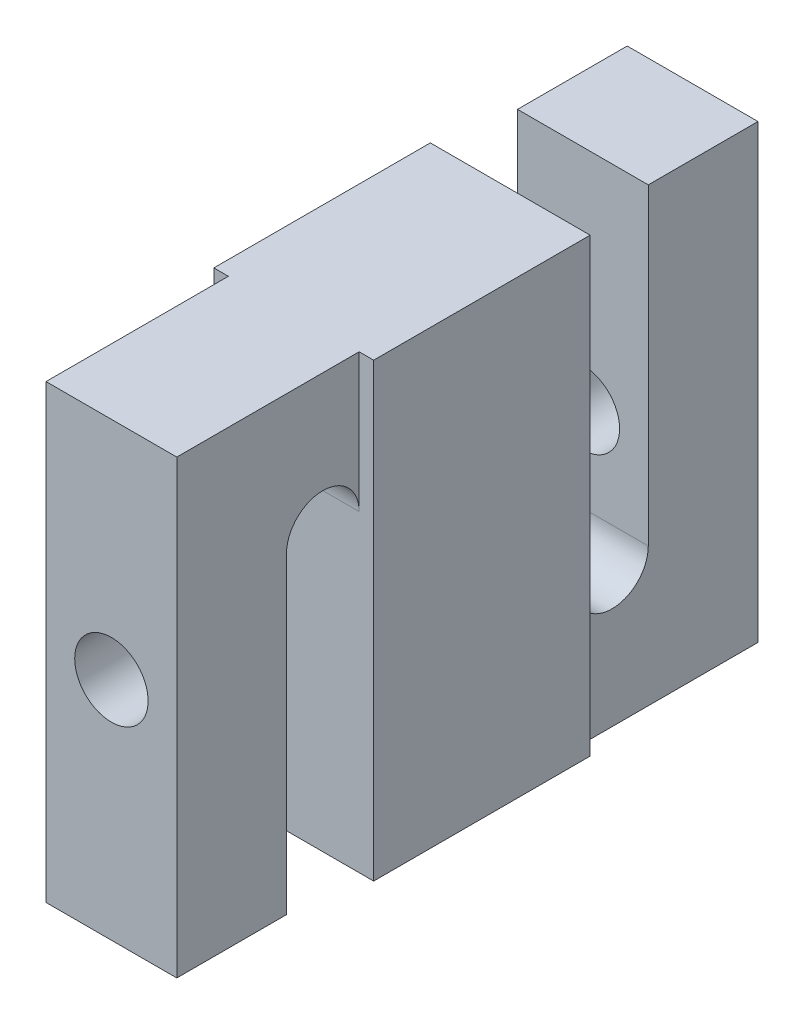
ISO-10303-21;
HEADER;
FILE_DESCRIPTION(('STEP AP214'),'2;1');
FILE_NAME('part.step','',(''),(''),'','','');
FILE_SCHEMA(('AUTOMOTIVE_DESIGN { 1 0 10303 214 1 1 1 1 }'));
ENDSEC;
DATA;
#1=APPLICATION_CONTEXT('core data for automotive mechanical design processes');
#2=APPLICATION_PROTOCOL_DEFINITION('international standard','automotive_design',2000,#1);
#3=PRODUCT_CONTEXT('',#1,'mechanical');
#4=PRODUCT('Part','Part','',(#3));
#5=PRODUCT_RELATED_PRODUCT_CATEGORY('part','',(#4));
#6=PRODUCT_DEFINITION_FORMATION('','',#4);
#7=PRODUCT_DEFINITION_CONTEXT('part definition',#1,'design');
#8=PRODUCT_DEFINITION('design','',#6,#7);
#9=PRODUCT_DEFINITION_SHAPE('','',#8);
#10=(LENGTH_UNIT() NAMED_UNIT(*) SI_UNIT(.MILLI.,.METRE.));
#11=(NAMED_UNIT(*) PLANE_ANGLE_UNIT() SI_UNIT($,.RADIAN.));
#12=(NAMED_UNIT(*) SI_UNIT($,.STERADIAN.) SOLID_ANGLE_UNIT());
#13=UNCERTAINTY_MEASURE_WITH_UNIT(LENGTH_MEASURE(1.E-05),#10,'distance_accuracy_value','');
#14=(GEOMETRIC_REPRESENTATION_CONTEXT(3) GLOBAL_UNCERTAINTY_ASSIGNED_CONTEXT((#13)) GLOBAL_UNIT_ASSIGNED_CONTEXT((#10,
#11,#12)) REPRESENTATION_CONTEXT('',''));
#15=CARTESIAN_POINT('',(0.,0.,0.));
#16=DIRECTION('',(0.,0.,1.));
#17=DIRECTION('',(1.,0.,0.));
#18=AXIS2_PLACEMENT_3D('',#15,#16,#17);
#19=CARTESIAN_POINT('',(9.,0.,39.9));
#20=DIRECTION('',(0.,0.,-1.));
#21=DIRECTION('',(-1.,0.,0.));
#22=AXIS2_PLACEMENT_3D('',#19,#20,#21);
#23=CYLINDRICAL_SURFACE('',#22,5.053);
#24=CARTESIAN_POINT('',(9.,0.,24.9));
#25=DIRECTION('',(0.,0.,-1.));
#26=DIRECTION('',(-1.,0.,0.));
#27=AXIS2_PLACEMENT_3D('',#24,#25,#26);
#28=CIRCLE('',#27,5.053);
#29=CARTESIAN_POINT('',(3.947,0.,24.9));
#30=VERTEX_POINT('',#29);
#31=EDGE_CURVE('E20',#30,#30,#28,.F.);
#32=ORIENTED_EDGE('',*,*,#31,.F.);
#33=EDGE_LOOP('',(#32));
#34=FACE_BOUND('',#33,.T.);
#35=CARTESIAN_POINT('',(9.,0.,40.));
#36=DIRECTION('',(0.,0.,-1.));
#37=DIRECTION('',(-1.,0.,0.));
#38=AXIS2_PLACEMENT_3D('',#35,#36,#37);
#39=CIRCLE('',#38,5.053);
#40=CARTESIAN_POINT('',(3.947,0.,40.));
#41=VERTEX_POINT('',#40);
#42=EDGE_CURVE('E160',#41,#41,#39,.F.);
#43=ORIENTED_EDGE('',*,*,#42,.T.);
#44=EDGE_LOOP('',(#43));
#45=FACE_BOUND('',#44,.T.);
#46=ADVANCED_FACE('F17',(#34,#45),#23,.F.);
#47=CARTESIAN_POINT('',(0.,-31.05,40.));
#48=DIRECTION('',(0.,-1.,0.));
#49=DIRECTION('',(0.,0.,-1.));
#50=AXIS2_PLACEMENT_3D('',#47,#48,#49);
#51=PLANE('',#50);
#52=DIRECTION('',(-1.,0.,0.));
#53=VECTOR('',#52,1.);
#54=CARTESIAN_POINT('',(0.,-31.05,24.9));
#55=LINE('',#54,#53);
#56=CARTESIAN_POINT('',(18.,-31.05,24.9));
#57=VERTEX_POINT('',#56);
#58=CARTESIAN_POINT('',(0.,-31.05,24.9));
#59=VERTEX_POINT('',#58);
#60=EDGE_CURVE('E177',#57,#59,#55,.T.);
#61=ORIENTED_EDGE('',*,*,#60,.F.);
#62=DIRECTION('',(0.,0.,-1.));
#63=VECTOR('',#62,1.);
#64=CARTESIAN_POINT('',(18.,-31.05,0.));
#65=LINE('',#64,#63);
#66=CARTESIAN_POINT('',(18.,-31.05,40.));
#67=VERTEX_POINT('',#66);
#68=EDGE_CURVE('E137',#67,#57,#65,.T.);
#69=ORIENTED_EDGE('',*,*,#68,.F.);
#70=DIRECTION('',(-1.,0.,0.));
#71=VECTOR('',#70,1.);
#72=CARTESIAN_POINT('',(0.,-31.05,40.));
#73=LINE('',#72,#71);
#74=CARTESIAN_POINT('',(0.,-31.05,40.));
#75=VERTEX_POINT('',#74);
#76=EDGE_CURVE('E163',#67,#75,#73,.T.);
#77=ORIENTED_EDGE('',*,*,#76,.T.);
#78=DIRECTION('',(0.,0.,-1.));
#79=VECTOR('',#78,1.);
#80=CARTESIAN_POINT('',(0.,-31.05,0.));
#81=LINE('',#80,#79);
#82=EDGE_CURVE('E224',#75,#59,#81,.T.);
#83=ORIENTED_EDGE('',*,*,#82,.T.);
#84=EDGE_LOOP('',(#61,#69,#77,#83));
#85=FACE_BOUND('',#84,.T.);
#86=ADVANCED_FACE('F425',(#85),#51,.T.);
#87=CARTESIAN_POINT('',(0.,-31.05,24.9));
#88=DIRECTION('',(0.,0.,-1.));
#89=DIRECTION('',(-1.,0.,0.));
#90=AXIS2_PLACEMENT_3D('',#87,#88,#89);
#91=PLANE('',#90);
#92=ORIENTED_EDGE('',*,*,#31,.T.);
#93=EDGE_LOOP('',(#92));
#94=FACE_BOUND('',#93,.T.);
#95=DIRECTION('',(1.,0.,0.));
#96=VECTOR('',#95,1.);
#97=CARTESIAN_POINT('',(9.,12.,24.9));
#98=LINE('',#97,#96);
#99=CARTESIAN_POINT('',(0.,12.,24.9));
#100=VERTEX_POINT('',#99);
#101=CARTESIAN_POINT('',(18.,12.,24.9));
#102=VERTEX_POINT('',#101);
#103=EDGE_CURVE('E142',#100,#102,#98,.T.);
#104=ORIENTED_EDGE('',*,*,#103,.T.);
#105=DIRECTION('',(0.,1.,0.));
#106=VECTOR('',#105,1.);
#107=CARTESIAN_POINT('',(18.,0.,24.9));
#108=LINE('',#107,#106);
#109=EDGE_CURVE('E128',#57,#102,#108,.T.);
#110=ORIENTED_EDGE('',*,*,#109,.F.);
#111=ORIENTED_EDGE('',*,*,#60,.T.);
#112=DIRECTION('',(0.,1.,0.));
#113=VECTOR('',#112,1.);
#114=CARTESIAN_POINT('',(0.,0.,24.9));
#115=LINE('',#114,#113);
#116=EDGE_CURVE('E145',#59,#100,#115,.T.);
#117=ORIENTED_EDGE('',*,*,#116,.T.);
#118=EDGE_LOOP('',(#104,#110,#111,#117));
#119=FACE_BOUND('',#118,.T.);
#120=ADVANCED_FACE('F143',(#94,#119),#91,.T.);
#121=CARTESIAN_POINT('',(9.,0.,-39.9));
#122=DIRECTION('',(0.,0.,1.));
#123=DIRECTION('',(1.,0.,0.));
#124=AXIS2_PLACEMENT_3D('',#121,#122,#123);
#125=CYLINDRICAL_SURFACE('',#124,5.053);
#126=CARTESIAN_POINT('',(9.,0.,-40.));
#127=DIRECTION('',(0.,0.,1.));
#128=DIRECTION('',(1.,0.,0.));
#129=AXIS2_PLACEMENT_3D('',#126,#127,#128);
#130=CIRCLE('',#129,5.053);
#131=CARTESIAN_POINT('',(14.053,0.,-40.));
#132=VERTEX_POINT('',#131);
#133=EDGE_CURVE('E191',#132,#132,#130,.F.);
#134=ORIENTED_EDGE('',*,*,#133,.T.);
#135=EDGE_LOOP('',(#134));
#136=FACE_BOUND('',#135,.T.);
#137=CARTESIAN_POINT('',(9.,0.,-24.9));
#138=DIRECTION('',(0.,0.,1.));
#139=DIRECTION('',(1.,0.,0.));
#140=AXIS2_PLACEMENT_3D('',#137,#138,#139);
#141=CIRCLE('',#140,5.053);
#142=CARTESIAN_POINT('',(14.053,0.,-24.9));
#143=VERTEX_POINT('',#142);
#144=EDGE_CURVE('E164',#143,#143,#141,.T.);
#145=ORIENTED_EDGE('',*,*,#144,.T.);
#146=EDGE_LOOP('',(#145));
#147=FACE_BOUND('',#146,.T.);
#148=ADVANCED_FACE('F432',(#136,#147),#125,.F.);
#149=CARTESIAN_POINT('',(0.,31.05,-40.));
#150=DIRECTION('',(0.,1.,0.));
#151=DIRECTION('',(0.,0.,1.));
#152=AXIS2_PLACEMENT_3D('',#149,#150,#151);
#153=PLANE('',#152);
#154=DIRECTION('',(-1.,0.,0.));
#155=VECTOR('',#154,1.);
#156=CARTESIAN_POINT('',(0.,31.05,-24.9));
#157=LINE('',#156,#155);
#158=CARTESIAN_POINT('',(0.,31.05,-24.9));
#159=VERTEX_POINT('',#158);
#160=CARTESIAN_POINT('',(18.,31.05,-24.9));
#161=VERTEX_POINT('',#160);
#162=EDGE_CURVE('E167',#159,#161,#157,.F.);
#163=ORIENTED_EDGE('',*,*,#162,.T.);
#164=DIRECTION('',(0.,0.,-1.));
#165=VECTOR('',#164,1.);
#166=CARTESIAN_POINT('',(18.,31.05,0.));
#167=LINE('',#166,#165);
#168=CARTESIAN_POINT('',(18.,31.05,-40.));
#169=VERTEX_POINT('',#168);
#170=EDGE_CURVE('E182',#169,#161,#167,.F.);
#171=ORIENTED_EDGE('',*,*,#170,.F.);
#172=DIRECTION('',(1.,0.,0.));
#173=VECTOR('',#172,1.);
#174=CARTESIAN_POINT('',(0.,31.05,-40.));
#175=LINE('',#174,#173);
#176=CARTESIAN_POINT('',(0.,31.05,-40.));
#177=VERTEX_POINT('',#176);
#178=EDGE_CURVE('E194',#169,#177,#175,.F.);
#179=ORIENTED_EDGE('',*,*,#178,.T.);
#180=DIRECTION('',(0.,0.,-1.));
#181=VECTOR('',#180,1.);
#182=CARTESIAN_POINT('',(0.,31.05,0.));
#183=LINE('',#182,#181);
#184=EDGE_CURVE('E149',#177,#159,#183,.F.);
#185=ORIENTED_EDGE('',*,*,#184,.T.);
#186=EDGE_LOOP('',(#163,#171,#179,#185));
#187=FACE_BOUND('',#186,.T.);
#188=ADVANCED_FACE('F380',(#187),#153,.T.);
#189=CARTESIAN_POINT('',(0.,-12.,-24.9));
#190=DIRECTION('',(0.,0.,-1.));
#191=DIRECTION('',(-1.,0.,0.));
#192=AXIS2_PLACEMENT_3D('',#189,#190,#191);
#193=PLANE('',#192);
#194=ORIENTED_EDGE('',*,*,#144,.F.);
#195=EDGE_LOOP('',(#194));
#196=FACE_BOUND('',#195,.T.);
#197=DIRECTION('',(0.,1.,0.));
#198=VECTOR('',#197,1.);
#199=CARTESIAN_POINT('',(0.,0.,-24.9));
#200=LINE('',#199,#198);
#201=CARTESIAN_POINT('',(0.,-12.,-24.9));
#202=VERTEX_POINT('',#201);
#203=EDGE_CURVE('E208',#159,#202,#200,.F.);
#204=ORIENTED_EDGE('',*,*,#203,.T.);
#205=DIRECTION('',(1.,0.,0.));
#206=VECTOR('',#205,1.);
#207=CARTESIAN_POINT('',(9.,-12.,-24.9));
#208=LINE('',#207,#206);
#209=CARTESIAN_POINT('',(18.,-12.,-24.9));
#210=VERTEX_POINT('',#209);
#211=EDGE_CURVE('E166',#202,#210,#208,.T.);
#212=ORIENTED_EDGE('',*,*,#211,.T.);
#213=DIRECTION('',(0.,1.,0.));
#214=VECTOR('',#213,1.);
#215=CARTESIAN_POINT('',(18.,0.,-24.9));
#216=LINE('',#215,#214);
#217=EDGE_CURVE('E185',#161,#210,#216,.F.);
#218=ORIENTED_EDGE('',*,*,#217,.F.);
#219=ORIENTED_EDGE('',*,*,#162,.F.);
#220=EDGE_LOOP('',(#204,#212,#218,#219));
#221=FACE_BOUND('',#220,.T.);
#222=ADVANCED_FACE('F367',(#196,#221),#193,.F.);
#223=CARTESIAN_POINT('',(9.,-12.,-19.9));
#224=DIRECTION('',(1.,0.,0.));
#225=DIRECTION('',(0.,0.,-1.));
#226=AXIS2_PLACEMENT_3D('',#223,#224,#225);
#227=CYLINDRICAL_SURFACE('',#226,5.);
#228=CARTESIAN_POINT('',(0.,-12.,-19.9));
#229=DIRECTION('',(1.,0.,0.));
#230=DIRECTION('',(0.,0.,-1.));
#231=AXIS2_PLACEMENT_3D('',#228,#229,#230);
#232=CIRCLE('',#231,5.);
#233=CARTESIAN_POINT('',(0.,-12.,-14.9));
#234=VERTEX_POINT('',#233);
#235=EDGE_CURVE('E197',#202,#234,#232,.F.);
#236=ORIENTED_EDGE('',*,*,#235,.T.);
#237=DIRECTION('',(1.,0.,0.));
#238=VECTOR('',#237,1.);
#239=CARTESIAN_POINT('',(0.,-12.,-14.9));
#240=LINE('',#239,#238);
#241=CARTESIAN_POINT('',(18.,-12.,-14.9));
#242=VERTEX_POINT('',#241);
#243=EDGE_CURVE('E307',#234,#242,#240,.T.);
#244=ORIENTED_EDGE('',*,*,#243,.T.);
#245=CARTESIAN_POINT('',(18.,-12.,-19.9));
#246=DIRECTION('',(1.,0.,0.));
#247=DIRECTION('',(0.,0.,-1.));
#248=AXIS2_PLACEMENT_3D('',#245,#246,#247);
#249=CIRCLE('',#248,5.);
#250=EDGE_CURVE('E228',#210,#242,#249,.F.);
#251=ORIENTED_EDGE('',*,*,#250,.F.);
#252=ORIENTED_EDGE('',*,*,#211,.F.);
#253=EDGE_LOOP('',(#236,#244,#251,#252));
#254=FACE_BOUND('',#253,.T.);
#255=ADVANCED_FACE('F368',(#254),#227,.F.);
#256=CARTESIAN_POINT('',(0.,-31.05,40.));
#257=DIRECTION('',(0.,0.,-1.));
#258=DIRECTION('',(-1.,0.,0.));
#259=AXIS2_PLACEMENT_3D('',#256,#257,#258);
#260=PLANE('',#259);
#261=ORIENTED_EDGE('',*,*,#42,.F.);
#262=EDGE_LOOP('',(#261));
#263=FACE_BOUND('',#262,.T.);
#264=DIRECTION('',(0.,1.,0.));
#265=VECTOR('',#264,1.);
#266=CARTESIAN_POINT('',(0.,0.,40.));
#267=LINE('',#266,#265);
#268=CARTESIAN_POINT('',(0.,31.05,40.));
#269=VERTEX_POINT('',#268);
#270=EDGE_CURVE('E162',#269,#75,#267,.F.);
#271=ORIENTED_EDGE('',*,*,#270,.T.);
#272=ORIENTED_EDGE('',*,*,#76,.F.);
#273=DIRECTION('',(0.,1.,0.));
#274=VECTOR('',#273,1.);
#275=CARTESIAN_POINT('',(18.,0.,40.));
#276=LINE('',#275,#274);
#277=CARTESIAN_POINT('',(18.,31.05,40.));
#278=VERTEX_POINT('',#277);
#279=EDGE_CURVE('E218',#278,#67,#276,.F.);
#280=ORIENTED_EDGE('',*,*,#279,.F.);
#281=DIRECTION('',(1.,0.,0.));
#282=VECTOR('',#281,1.);
#283=CARTESIAN_POINT('',(0.,31.05,40.));
#284=LINE('',#283,#282);
#285=EDGE_CURVE('E263',#269,#278,#284,.T.);
#286=ORIENTED_EDGE('',*,*,#285,.F.);
#287=EDGE_LOOP('',(#271,#272,#280,#286));
#288=FACE_BOUND('',#287,.T.);
#289=ADVANCED_FACE('F370',(#263,#288),#260,.F.);
#290=CARTESIAN_POINT('',(0.,0.,0.));
#291=DIRECTION('',(1.,0.,0.));
#292=DIRECTION('',(0.,0.,-1.));
#293=AXIS2_PLACEMENT_3D('',#290,#291,#292);
#294=PLANE('',#293);
#295=CARTESIAN_POINT('',(0.,12.,19.9));
#296=DIRECTION('',(1.,0.,0.));
#297=DIRECTION('',(0.,0.,-1.));
#298=AXIS2_PLACEMENT_3D('',#295,#296,#297);
#299=CIRCLE('',#298,5.);
#300=CARTESIAN_POINT('',(0.,12.,14.9));
#301=VERTEX_POINT('',#300);
#302=EDGE_CURVE('E150',#301,#100,#299,.T.);
#303=ORIENTED_EDGE('',*,*,#302,.T.);
#304=ORIENTED_EDGE('',*,*,#116,.F.);
#305=ORIENTED_EDGE('',*,*,#82,.F.);
#306=ORIENTED_EDGE('',*,*,#270,.F.);
#307=DIRECTION('',(0.,0.,1.));
#308=VECTOR('',#307,1.);
#309=CARTESIAN_POINT('',(0.,31.05,-40.));
#310=LINE('',#309,#308);
#311=CARTESIAN_POINT('',(0.,31.05,14.9));
#312=VERTEX_POINT('',#311);
#313=EDGE_CURVE('E290',#312,#269,#310,.T.);
#314=ORIENTED_EDGE('',*,*,#313,.F.);
#315=DIRECTION('',(0.,-1.,0.));
#316=VECTOR('',#315,1.);
#317=CARTESIAN_POINT('',(0.,12.,14.9));
#318=LINE('',#317,#316);
#319=EDGE_CURVE('E279',#301,#312,#318,.F.);
#320=ORIENTED_EDGE('',*,*,#319,.F.);
#321=EDGE_LOOP('',(#303,#304,#305,#306,#314,#320));
#322=FACE_BOUND('',#321,.T.);
#323=ADVANCED_FACE('F377',(#322),#294,.F.);
#324=CARTESIAN_POINT('',(18.,0.,0.));
#325=DIRECTION('',(1.,0.,0.));
#326=DIRECTION('',(0.,0.,-1.));
#327=AXIS2_PLACEMENT_3D('',#324,#325,#326);
#328=PLANE('',#327);
#329=CARTESIAN_POINT('',(18.,12.,19.9));
#330=DIRECTION('',(1.,0.,0.));
#331=DIRECTION('',(0.,0.,-1.));
#332=AXIS2_PLACEMENT_3D('',#329,#330,#331);
#333=CIRCLE('',#332,5.);
#334=CARTESIAN_POINT('',(18.,12.,14.9));
#335=VERTEX_POINT('',#334);
#336=EDGE_CURVE('E133',#102,#335,#333,.F.);
#337=ORIENTED_EDGE('',*,*,#336,.T.);
#338=DIRECTION('',(0.,-1.,0.));
#339=VECTOR('',#338,1.);
#340=CARTESIAN_POINT('',(18.,12.,14.9));
#341=LINE('',#340,#339);
#342=CARTESIAN_POINT('',(18.,31.05,14.9));
#343=VERTEX_POINT('',#342);
#344=EDGE_CURVE('E250',#343,#335,#341,.T.);
#345=ORIENTED_EDGE('',*,*,#344,.F.);
#346=DIRECTION('',(0.,0.,1.));
#347=VECTOR('',#346,1.);
#348=CARTESIAN_POINT('',(18.,31.05,-40.));
#349=LINE('',#348,#347);
#350=EDGE_CURVE('E260',#278,#343,#349,.F.);
#351=ORIENTED_EDGE('',*,*,#350,.F.);
#352=ORIENTED_EDGE('',*,*,#279,.T.);
#353=ORIENTED_EDGE('',*,*,#68,.T.);
#354=ORIENTED_EDGE('',*,*,#109,.T.);
#355=EDGE_LOOP('',(#337,#345,#351,#352,#353,#354));
#356=FACE_BOUND('',#355,.T.);
#357=ADVANCED_FACE('F130',(#356),#328,.T.);
#358=CARTESIAN_POINT('',(9.,12.,19.9));
#359=DIRECTION('',(1.,0.,0.));
#360=DIRECTION('',(0.,0.,-1.));
#361=AXIS2_PLACEMENT_3D('',#358,#359,#360);
#362=CYLINDRICAL_SURFACE('',#361,5.);
#363=ORIENTED_EDGE('',*,*,#302,.F.);
#364=DIRECTION('',(1.,0.,0.));
#365=VECTOR('',#364,1.);
#366=CARTESIAN_POINT('',(0.,12.,14.9));
#367=LINE('',#366,#365);
#368=EDGE_CURVE('E154',#335,#301,#367,.F.);
#369=ORIENTED_EDGE('',*,*,#368,.F.);
#370=ORIENTED_EDGE('',*,*,#336,.F.);
#371=ORIENTED_EDGE('',*,*,#103,.F.);
#372=EDGE_LOOP('',(#363,#369,#370,#371));
#373=FACE_BOUND('',#372,.T.);
#374=ADVANCED_FACE('F152',(#373),#362,.F.);
#375=CARTESIAN_POINT('',(0.,0.,0.));
#376=DIRECTION('',(1.,0.,0.));
#377=DIRECTION('',(0.,0.,-1.));
#378=AXIS2_PLACEMENT_3D('',#375,#376,#377);
#379=PLANE('',#378);
#380=ORIENTED_EDGE('',*,*,#235,.F.);
#381=ORIENTED_EDGE('',*,*,#203,.F.);
#382=ORIENTED_EDGE('',*,*,#184,.F.);
#383=DIRECTION('',(0.,1.,0.));
#384=VECTOR('',#383,1.);
#385=CARTESIAN_POINT('',(0.,31.05,-40.));
#386=LINE('',#385,#384);
#387=CARTESIAN_POINT('',(0.,-31.05,-40.));
#388=VERTEX_POINT('',#387);
#389=EDGE_CURVE('E196',#177,#388,#386,.F.);
#390=ORIENTED_EDGE('',*,*,#389,.T.);
#391=DIRECTION('',(0.,0.,-1.));
#392=VECTOR('',#391,1.);
#393=CARTESIAN_POINT('',(0.,-31.05,40.));
#394=LINE('',#393,#392);
#395=CARTESIAN_POINT('',(0.,-31.05,-14.9));
#396=VERTEX_POINT('',#395);
#397=EDGE_CURVE('E204',#396,#388,#394,.T.);
#398=ORIENTED_EDGE('',*,*,#397,.F.);
#399=DIRECTION('',(0.,1.,0.));
#400=VECTOR('',#399,1.);
#401=CARTESIAN_POINT('',(0.,31.05,-14.9));
#402=LINE('',#401,#400);
#403=EDGE_CURVE('E231',#396,#234,#402,.T.);
#404=ORIENTED_EDGE('',*,*,#403,.T.);
#405=EDGE_LOOP('',(#380,#381,#382,#390,#398,#404));
#406=FACE_BOUND('',#405,.T.);
#407=ADVANCED_FACE('F344',(#406),#379,.F.);
#408=CARTESIAN_POINT('',(0.,31.05,-40.));
#409=DIRECTION('',(0.,0.,1.));
#410=DIRECTION('',(1.,0.,0.));
#411=AXIS2_PLACEMENT_3D('',#408,#409,#410);
#412=PLANE('',#411);
#413=ORIENTED_EDGE('',*,*,#133,.F.);
#414=EDGE_LOOP('',(#413));
#415=FACE_BOUND('',#414,.T.);
#416=ORIENTED_EDGE('',*,*,#389,.F.);
#417=ORIENTED_EDGE('',*,*,#178,.F.);
#418=DIRECTION('',(0.,1.,0.));
#419=VECTOR('',#418,1.);
#420=CARTESIAN_POINT('',(18.,0.,-40.));
#421=LINE('',#420,#419);
#422=CARTESIAN_POINT('',(18.,-31.05,-40.));
#423=VERTEX_POINT('',#422);
#424=EDGE_CURVE('E186',#423,#169,#421,.T.);
#425=ORIENTED_EDGE('',*,*,#424,.F.);
#426=DIRECTION('',(1.,0.,0.));
#427=VECTOR('',#426,1.);
#428=CARTESIAN_POINT('',(0.,-31.05,-40.));
#429=LINE('',#428,#427);
#430=EDGE_CURVE('E200',#388,#423,#429,.T.);
#431=ORIENTED_EDGE('',*,*,#430,.F.);
#432=EDGE_LOOP('',(#416,#417,#425,#431));
#433=FACE_BOUND('',#432,.T.);
#434=ADVANCED_FACE('F349',(#415,#433),#412,.F.);
#435=CARTESIAN_POINT('',(18.,0.,0.));
#436=DIRECTION('',(1.,0.,0.));
#437=DIRECTION('',(0.,0.,-1.));
#438=AXIS2_PLACEMENT_3D('',#435,#436,#437);
#439=PLANE('',#438);
#440=ORIENTED_EDGE('',*,*,#250,.T.);
#441=DIRECTION('',(0.,1.,0.));
#442=VECTOR('',#441,1.);
#443=CARTESIAN_POINT('',(18.,31.05,-14.9));
#444=LINE('',#443,#442);
#445=CARTESIAN_POINT('',(18.,-31.05,-14.9));
#446=VERTEX_POINT('',#445);
#447=EDGE_CURVE('E309',#242,#446,#444,.F.);
#448=ORIENTED_EDGE('',*,*,#447,.T.);
#449=DIRECTION('',(0.,0.,-1.));
#450=VECTOR('',#449,1.);
#451=CARTESIAN_POINT('',(18.,-31.05,40.));
#452=LINE('',#451,#450);
#453=EDGE_CURVE('E203',#423,#446,#452,.F.);
#454=ORIENTED_EDGE('',*,*,#453,.F.);
#455=ORIENTED_EDGE('',*,*,#424,.T.);
#456=ORIENTED_EDGE('',*,*,#170,.T.);
#457=ORIENTED_EDGE('',*,*,#217,.T.);
#458=EDGE_LOOP('',(#440,#448,#454,#455,#456,#457));
#459=FACE_BOUND('',#458,.T.);
#460=ADVANCED_FACE('F353',(#459),#439,.T.);
#461=CARTESIAN_POINT('',(-2.,31.05,14.9));
#462=DIRECTION('',(1.,0.,0.));
#463=DIRECTION('',(0.,0.,-1.));
#464=AXIS2_PLACEMENT_3D('',#461,#462,#463);
#465=PLANE('',#464);
#466=DIRECTION('',(0.,0.,-1.));
#467=VECTOR('',#466,1.);
#468=CARTESIAN_POINT('',(-2.,-31.05,40.));
#469=LINE('',#468,#467);
#470=CARTESIAN_POINT('',(-2.,-31.05,14.9));
#471=VERTEX_POINT('',#470);
#472=CARTESIAN_POINT('',(-2.,-31.05,-14.9));
#473=VERTEX_POINT('',#472);
#474=EDGE_CURVE('E337',#471,#473,#469,.T.);
#475=ORIENTED_EDGE('',*,*,#474,.F.);
#476=DIRECTION('',(0.,-1.,0.));
#477=VECTOR('',#476,1.);
#478=CARTESIAN_POINT('',(-2.,12.,14.9));
#479=LINE('',#478,#477);
#480=CARTESIAN_POINT('',(-2.,31.05,14.9));
#481=VERTEX_POINT('',#480);
#482=EDGE_CURVE('E257',#481,#471,#479,.T.);
#483=ORIENTED_EDGE('',*,*,#482,.F.);
#484=DIRECTION('',(0.,0.,1.));
#485=VECTOR('',#484,1.);
#486=CARTESIAN_POINT('',(-2.,31.05,-40.));
#487=LINE('',#486,#485);
#488=CARTESIAN_POINT('',(-2.,31.05,-14.9));
#489=VERTEX_POINT('',#488);
#490=EDGE_CURVE('E283',#489,#481,#487,.T.);
#491=ORIENTED_EDGE('',*,*,#490,.F.);
#492=DIRECTION('',(0.,1.,0.));
#493=VECTOR('',#492,1.);
#494=CARTESIAN_POINT('',(-2.,31.05,-14.9));
#495=LINE('',#494,#493);
#496=EDGE_CURVE('E293',#489,#473,#495,.F.);
#497=ORIENTED_EDGE('',*,*,#496,.T.);
#498=EDGE_LOOP('',(#475,#483,#491,#497));
#499=FACE_BOUND('',#498,.T.);
#500=ADVANCED_FACE('F400',(#499),#465,.F.);
#501=CARTESIAN_POINT('',(0.,31.05,-14.9));
#502=DIRECTION('',(0.,0.,1.));
#503=DIRECTION('',(1.,0.,0.));
#504=AXIS2_PLACEMENT_3D('',#501,#502,#503);
#505=PLANE('',#504);
#506=ORIENTED_EDGE('',*,*,#496,.F.);
#507=DIRECTION('',(1.,0.,0.));
#508=VECTOR('',#507,1.);
#509=CARTESIAN_POINT('',(0.,31.05,-14.9));
#510=LINE('',#509,#508);
#511=CARTESIAN_POINT('',(20.,31.05,-14.9));
#512=VERTEX_POINT('',#511);
#513=EDGE_CURVE('E262',#512,#489,#510,.F.);
#514=ORIENTED_EDGE('',*,*,#513,.F.);
#515=DIRECTION('',(0.,1.,0.));
#516=VECTOR('',#515,1.);
#517=CARTESIAN_POINT('',(20.,31.05,-14.9));
#518=LINE('',#517,#516);
#519=CARTESIAN_POINT('',(20.,-31.05,-14.9));
#520=VERTEX_POINT('',#519);
#521=EDGE_CURVE('E273',#520,#512,#518,.T.);
#522=ORIENTED_EDGE('',*,*,#521,.F.);
#523=DIRECTION('',(1.,0.,0.));
#524=VECTOR('',#523,1.);
#525=CARTESIAN_POINT('',(0.,-31.05,-14.9));
#526=LINE('',#525,#524);
#527=EDGE_CURVE('E313',#446,#520,#526,.T.);
#528=ORIENTED_EDGE('',*,*,#527,.F.);
#529=ORIENTED_EDGE('',*,*,#447,.F.);
#530=ORIENTED_EDGE('',*,*,#243,.F.);
#531=ORIENTED_EDGE('',*,*,#403,.F.);
#532=DIRECTION('',(1.,0.,0.));
#533=VECTOR('',#532,1.);
#534=CARTESIAN_POINT('',(0.,-31.05,-14.9));
#535=LINE('',#534,#533);
#536=EDGE_CURVE('E249',#473,#396,#535,.T.);
#537=ORIENTED_EDGE('',*,*,#536,.F.);
#538=EDGE_LOOP('',(#506,#514,#522,#528,#529,#530,#531,#537));
#539=FACE_BOUND('',#538,.T.);
#540=ADVANCED_FACE('F339',(#539),#505,.F.);
#541=CARTESIAN_POINT('',(0.,31.05,-40.));
#542=DIRECTION('',(0.,1.,0.));
#543=DIRECTION('',(0.,0.,1.));
#544=AXIS2_PLACEMENT_3D('',#541,#542,#543);
#545=PLANE('',#544);
#546=ORIENTED_EDGE('',*,*,#490,.T.);
#547=DIRECTION('',(1.,0.,0.));
#548=VECTOR('',#547,1.);
#549=CARTESIAN_POINT('',(0.,31.05,14.9));
#550=LINE('',#549,#548);
#551=EDGE_CURVE('E282',#312,#481,#550,.F.);
#552=ORIENTED_EDGE('',*,*,#551,.F.);
#553=ORIENTED_EDGE('',*,*,#313,.T.);
#554=ORIENTED_EDGE('',*,*,#285,.T.);
#555=ORIENTED_EDGE('',*,*,#350,.T.);
#556=DIRECTION('',(1.,0.,0.));
#557=VECTOR('',#556,1.);
#558=CARTESIAN_POINT('',(0.,31.05,14.9));
#559=LINE('',#558,#557);
#560=CARTESIAN_POINT('',(20.,31.05,14.9));
#561=VERTEX_POINT('',#560);
#562=EDGE_CURVE('E252',#561,#343,#559,.F.);
#563=ORIENTED_EDGE('',*,*,#562,.F.);
#564=DIRECTION('',(0.,0.,-1.));
#565=VECTOR('',#564,1.);
#566=CARTESIAN_POINT('',(20.,31.05,14.9));
#567=LINE('',#566,#565);
#568=EDGE_CURVE('E268',#512,#561,#567,.F.);
#569=ORIENTED_EDGE('',*,*,#568,.F.);
#570=ORIENTED_EDGE('',*,*,#513,.T.);
#571=EDGE_LOOP('',(#546,#552,#553,#554,#555,#563,#569,#570));
#572=FACE_BOUND('',#571,.T.);
#573=ADVANCED_FACE('F394',(#572),#545,.T.);
#574=CARTESIAN_POINT('',(0.,12.,14.9));
#575=DIRECTION('',(0.,0.,1.));
#576=DIRECTION('',(0.,-1.,0.));
#577=AXIS2_PLACEMENT_3D('',#574,#575,#576);
#578=PLANE('',#577);
#579=ORIENTED_EDGE('',*,*,#344,.T.);
#580=ORIENTED_EDGE('',*,*,#368,.T.);
#581=ORIENTED_EDGE('',*,*,#319,.T.);
#582=ORIENTED_EDGE('',*,*,#551,.T.);
#583=ORIENTED_EDGE('',*,*,#482,.T.);
#584=DIRECTION('',(1.,0.,0.));
#585=VECTOR('',#584,1.);
#586=CARTESIAN_POINT('',(0.,-31.05,14.9));
#587=LINE('',#586,#585);
#588=CARTESIAN_POINT('',(20.,-31.05,14.9));
#589=VERTEX_POINT('',#588);
#590=EDGE_CURVE('E35',#589,#471,#587,.F.);
#591=ORIENTED_EDGE('',*,*,#590,.F.);
#592=DIRECTION('',(0.,1.,0.));
#593=VECTOR('',#592,1.);
#594=CARTESIAN_POINT('',(20.,31.05,14.9));
#595=LINE('',#594,#593);
#596=EDGE_CURVE('E26',#561,#589,#595,.F.);
#597=ORIENTED_EDGE('',*,*,#596,.F.);
#598=ORIENTED_EDGE('',*,*,#562,.T.);
#599=EDGE_LOOP('',(#579,#580,#581,#582,#583,#591,#597,#598));
#600=FACE_BOUND('',#599,.T.);
#601=ADVANCED_FACE('F389',(#600),#578,.T.);
#602=CARTESIAN_POINT('',(0.,-31.05,40.));
#603=DIRECTION('',(0.,-1.,0.));
#604=DIRECTION('',(0.,0.,-1.));
#605=AXIS2_PLACEMENT_3D('',#602,#603,#604);
#606=PLANE('',#605);
#607=ORIENTED_EDGE('',*,*,#590,.T.);
#608=ORIENTED_EDGE('',*,*,#474,.T.);
#609=ORIENTED_EDGE('',*,*,#536,.T.);
#610=ORIENTED_EDGE('',*,*,#397,.T.);
#611=ORIENTED_EDGE('',*,*,#430,.T.);
#612=ORIENTED_EDGE('',*,*,#453,.T.);
#613=ORIENTED_EDGE('',*,*,#527,.T.);
#614=DIRECTION('',(0.,0.,-1.));
#615=VECTOR('',#614,1.);
#616=CARTESIAN_POINT('',(20.,-31.05,14.9));
#617=LINE('',#616,#615);
#618=EDGE_CURVE('E11',#589,#520,#617,.T.);
#619=ORIENTED_EDGE('',*,*,#618,.F.);
#620=EDGE_LOOP('',(#607,#608,#609,#610,#611,#612,#613,#619));
#621=FACE_BOUND('',#620,.T.);
#622=ADVANCED_FACE('F334',(#621),#606,.T.);
#623=CARTESIAN_POINT('',(20.,31.05,14.9));
#624=DIRECTION('',(1.,0.,0.));
#625=DIRECTION('',(0.,0.,-1.));
#626=AXIS2_PLACEMENT_3D('',#623,#624,#625);
#627=PLANE('',#626);
#628=ORIENTED_EDGE('',*,*,#596,.T.);
#629=ORIENTED_EDGE('',*,*,#618,.T.);
#630=ORIENTED_EDGE('',*,*,#521,.T.);
#631=ORIENTED_EDGE('',*,*,#568,.T.);
#632=EDGE_LOOP('',(#628,#629,#630,#631));
#633=FACE_BOUND('',#632,.T.);
#634=ADVANCED_FACE('F383',(#633),#627,.T.);
#635=CLOSED_SHELL('',(#46,#86,#120,#148,#188,#222,#255,#289,#323,#357,#374,#407,#434,#460,#500,
#540,#573,#601,#622,#634));
#636=MANIFOLD_SOLID_BREP('B1',#635);
#637=ADVANCED_BREP_SHAPE_REPRESENTATION('',(#18,#636),#14);
#638=SHAPE_DEFINITION_REPRESENTATION(#9,#637);
ENDSEC;
END-ISO-10303-21;
